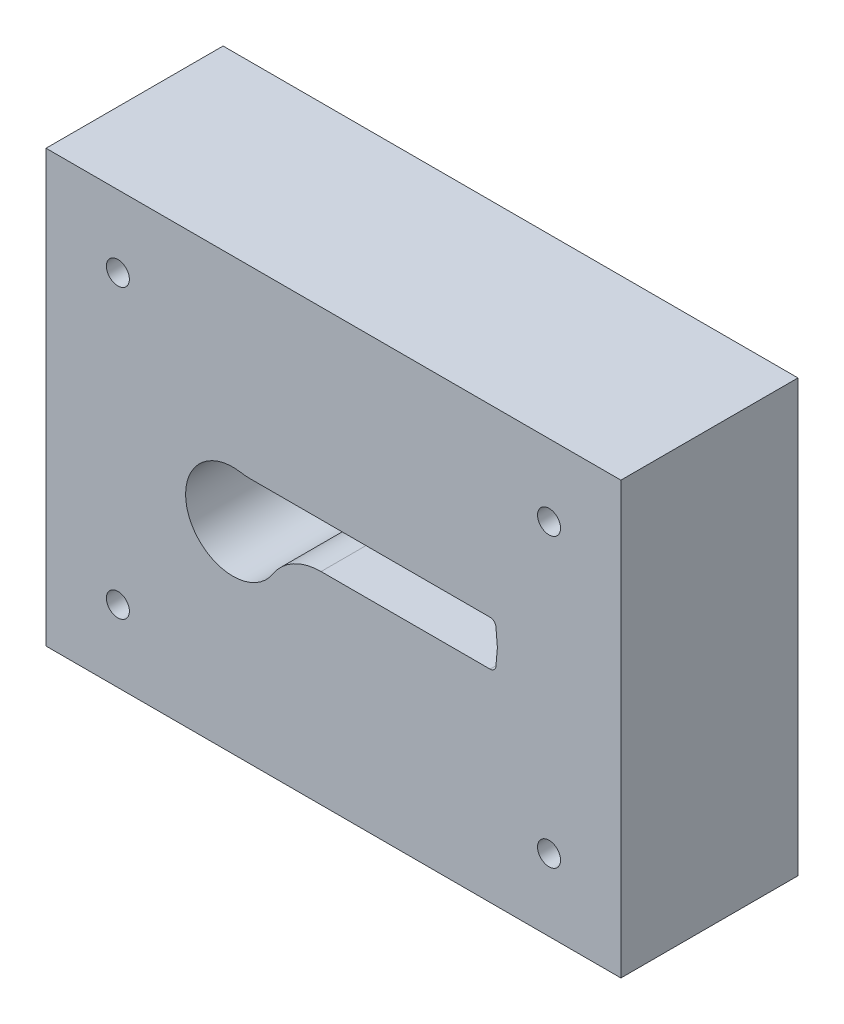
from build123d import *

# Parameters (mm, degrees)
ESQUISSE1_W                = 200
ESQUISSE1_H                = 150
BASE_EXTRUSION_DEPTH       = 65
ENL_V_MAT_EXTRU_1_DEPTH    = 259.311827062
ESQUISSE3_W                = 223.324854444
ESQUISSE3_H                = 172.91724444
ENL_V_MAT_EXTRU_2_DEPTH    = 3.4
CONG_1_R                   = 3
TROU_TARAUD_M10X1_52_D     = 8
TROU_TARAUD_M10X1_52_DEPTH = 43
TROU_TARAUD_M10X1_52_TIP   = 2.309401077


with BuildPart() as part:
    # Esquisse1 → Base-Extrusion (new body)
    with BuildSketch(Plane.XY):
        with Locations((100, 75)):
            Rectangle(ESQUISSE1_W, ESQUISSE1_H)
    extrude(amount=BASE_EXTRUSION_DEPTH)

    # Esquisse2 → Enl_v. mat.-Extru.1 (cut, through all)
    with BuildSketch(Plane.XY.offset(65)):
        with BuildLine():
            Line((71.07819052, 85.935), (154.489847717, 85.935))
            ThreePointArc((154.489847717, 85.935), (155.861295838, 85.401672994), (156.512122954, 84.081926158))
            Line((156.512122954, 84.081926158), (157.033723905, 78.12))
            Line((157.033723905, 78.12), (156.512122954, 72.158073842))
            ThreePointArc((156.512122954, 72.158073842), (155.861295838, 70.838327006), (154.489847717, 70.305))
            Line((154.489847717, 70.305), (95.681427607, 70.305))
            ThreePointArc((95.681427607, 70.305), (86.083538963, 67.855711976), (78.832928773, 61.106850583))
            ThreePointArc((78.832928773, 61.106850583), (49.957582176, 63.354423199), (67.740393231, 86.215063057))
            ThreePointArc((67.740393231, 86.215063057), (69.403427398, 86.005138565), (71.07819052, 85.935))
        make_face()
    extrude(amount=-ENL_V_MAT_EXTRU_1_DEPTH, mode=Mode.SUBTRACT)

    # Esquisse3 → Enl_v. mat.-Extru.2 (cut)
    with BuildSketch(Plane(origin=(0, 0, 0), x_dir=(-1, 0, 0), z_dir=(0, 0, -1))):
        with Locations((-99.042893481, 73.404822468)):
            Rectangle(ESQUISSE3_W, ESQUISSE3_H)
        with BuildLine():
            Line((-161.049003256, 78.12), (-160.496901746, 71.809450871))
            ThreePointArc((-160.496901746, 71.809450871), (-158.563656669, 67.889217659), (-154.489847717, 66.305))
            Line((-154.489847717, 66.305), (-95.681427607, 66.305))
            ThreePointArc((-95.681427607, 66.305), (-88.000241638, 64.344835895), (-82.197581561, 58.943725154))
            ThreePointArc((-82.197581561, 58.943725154), (-46.298739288, 61.737986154), (-68.40695285, 90.159134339))
            ThreePointArc((-68.40695285, 90.159134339), (-69.737878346, 89.991131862), (-71.07819052, 89.935))
            Line((-71.07819052, 89.935), (-154.489847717, 89.935))
            ThreePointArc((-154.489847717, 89.935), (-158.563656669, 88.350782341), (-160.496901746, 84.430549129))
            Line((-160.496901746, 84.430549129), (-161.049003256, 78.12))
        make_face(mode=Mode.SUBTRACT)
    extrude(amount=-ENL_V_MAT_EXTRU_2_DEPTH, mode=Mode.SUBTRACT)

    # Cong_1
    cong_1_edges = [part.edges().sort_by_distance(p)[0] for p in [
        (160.772952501, 74.964725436, 3.4),
        (160.772952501, 81.275274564, 3.4),
        (158.563656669, 67.889217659, 3.4),
        (158.563656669, 88.350782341, 3.4),
        (125.085637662, 66.305, 3.4),
        (112.784019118, 89.935, 3.4),
        (88.000241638, 64.344835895, 3.4),
        (69.737878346, 89.991131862, 3.4),
        (46.298739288, 61.737986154, 3.4),
    ]]
    fillet(cong_1_edges, radius=CONG_1_R)

    # Trou taraud_ M10x1.52
    with Locations(Plane.XY.offset(65)):
        with Locations((25, 125), (175, 125), (175, 25), (25, 25)):
            Hole(TROU_TARAUD_M10X1_52_D / 2, depth=TROU_TARAUD_M10X1_52_DEPTH)
            with Locations((0, 0, -(TROU_TARAUD_M10X1_52_DEPTH + TROU_TARAUD_M10X1_52_TIP / 2))):  # 120° drill point
                Cone(0, TROU_TARAUD_M10X1_52_D / 2, TROU_TARAUD_M10X1_52_TIP, mode=Mode.SUBTRACT)


solid = part.part
